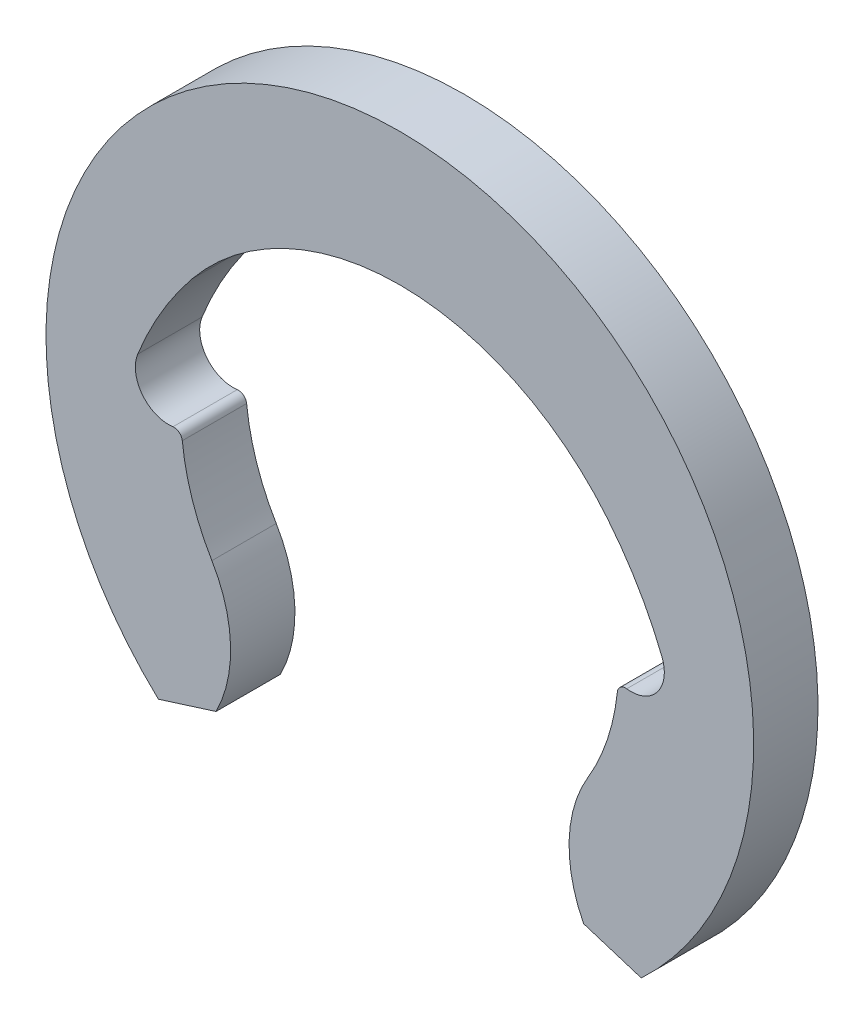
from build123d import *

# Parameters (mm, degrees)
EXTRUDE1_DEPTH = 0.1905


with BuildPart() as part:
    # Sketch1 → Extrude1 (new, symmetric)
    with BuildSketch(Plane.XY):
        with BuildLine():
            Line((-1.088536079, -1.424224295), (-1.429880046, -1.531849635))
            ThreePointArc((-1.429880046, -1.531849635), (0, 2.0955), (1.429880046, -1.531849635))
            Line((1.429880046, -1.531849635), (1.088536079, -1.424224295))
            ThreePointArc((1.088536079, -1.424224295), (1.002551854, -1.04034242), (1.113009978, -0.662774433))
            ThreePointArc((1.113009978, -0.662774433), (1.229299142, -0.408515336), (1.288322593, -0.135225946))
            ThreePointArc((1.288322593, -0.135225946), (1.306814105, -0.101703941), (1.343734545, -0.091577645))
            ThreePointArc((1.343734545, -0.091577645), (1.524951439, -0.017341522), (1.552425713, 0.176554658))
            ThreePointArc((1.552425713, 0.176554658), (1.412221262, 0.462469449), (1.2303125, 0.723838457))
            ThreePointArc((1.2303125, 0.723838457), (0, 1.3081), (-1.2303125, 0.723838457))
            ThreePointArc((-1.2303125, 0.723838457), (-1.412221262, 0.462469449), (-1.552425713, 0.176554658))
            ThreePointArc((-1.552425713, 0.176554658), (-1.524951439, -0.017341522), (-1.343734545, -0.091577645))
            ThreePointArc((-1.343734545, -0.091577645), (-1.306814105, -0.101703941), (-1.288322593, -0.135225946))
            ThreePointArc((-1.288322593, -0.135225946), (-1.229299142, -0.408515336), (-1.113009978, -0.662774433))
            ThreePointArc((-1.113009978, -0.662774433), (-1.002551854, -1.04034242), (-1.088536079, -1.424224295))
        make_face()
    extrude(amount=EXTRUDE1_DEPTH, both=True)


solid = part.part
